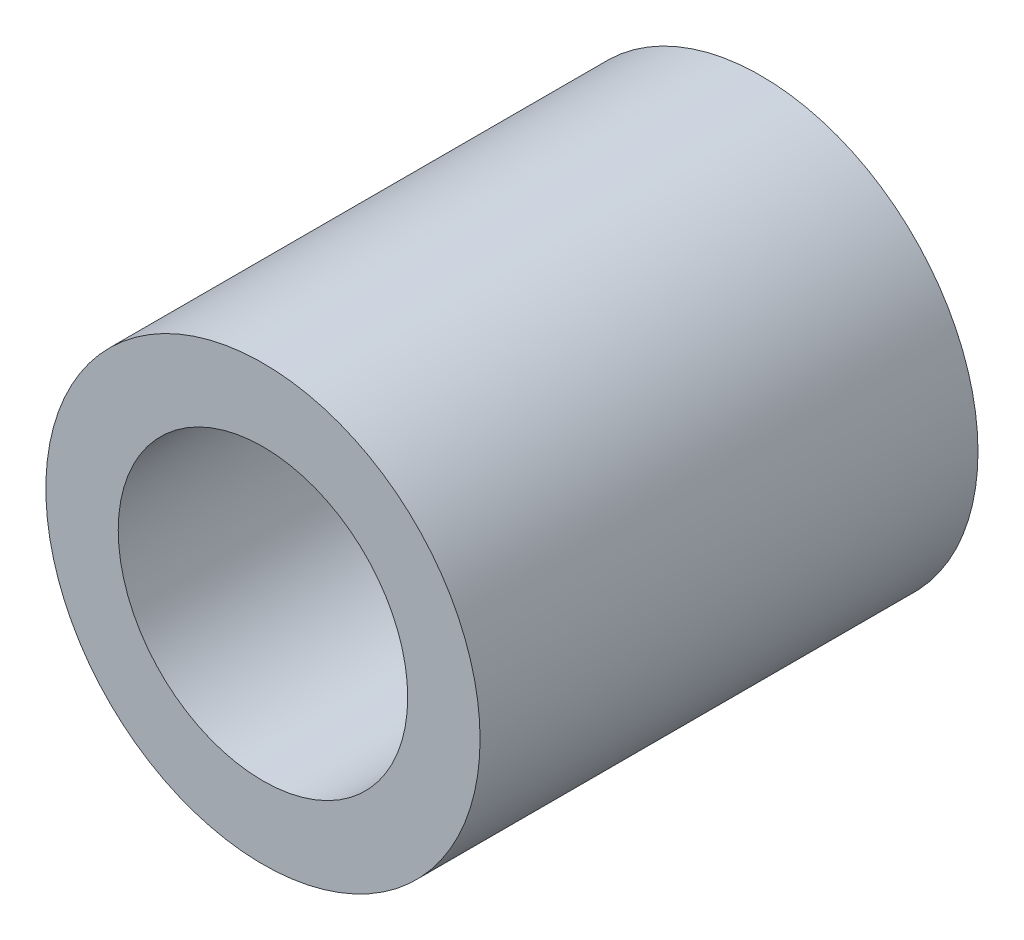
ISO-10303-21;
HEADER;
FILE_DESCRIPTION(('STEP AP214'),'2;1');
FILE_NAME('part.step','',(''),(''),'','','');
FILE_SCHEMA(('AUTOMOTIVE_DESIGN { 1 0 10303 214 1 1 1 1 }'));
ENDSEC;
DATA;
#1=APPLICATION_CONTEXT('core data for automotive mechanical design processes');
#2=APPLICATION_PROTOCOL_DEFINITION('international standard','automotive_design',2000,#1);
#3=PRODUCT_CONTEXT('',#1,'mechanical');
#4=PRODUCT('Part','Part','',(#3));
#5=PRODUCT_RELATED_PRODUCT_CATEGORY('part','',(#4));
#6=PRODUCT_DEFINITION_FORMATION('','',#4);
#7=PRODUCT_DEFINITION_CONTEXT('part definition',#1,'design');
#8=PRODUCT_DEFINITION('design','',#6,#7);
#9=PRODUCT_DEFINITION_SHAPE('','',#8);
#10=(LENGTH_UNIT() NAMED_UNIT(*) SI_UNIT(.MILLI.,.METRE.));
#11=(NAMED_UNIT(*) PLANE_ANGLE_UNIT() SI_UNIT($,.RADIAN.));
#12=(NAMED_UNIT(*) SI_UNIT($,.STERADIAN.) SOLID_ANGLE_UNIT());
#13=UNCERTAINTY_MEASURE_WITH_UNIT(LENGTH_MEASURE(1.E-05),#10,'distance_accuracy_value','');
#14=(GEOMETRIC_REPRESENTATION_CONTEXT(3) GLOBAL_UNCERTAINTY_ASSIGNED_CONTEXT((#13)) GLOBAL_UNIT_ASSIGNED_CONTEXT((#10,
#11,#12)) REPRESENTATION_CONTEXT('',''));
#15=CARTESIAN_POINT('',(0.,0.,0.));
#16=DIRECTION('',(0.,0.,1.));
#17=DIRECTION('',(1.,0.,0.));
#18=AXIS2_PLACEMENT_3D('',#15,#16,#17);
#19=CARTESIAN_POINT('',(0.,0.,10.922));
#20=DIRECTION('',(0.,0.,1.));
#21=DIRECTION('',(1.,0.,0.));
#22=AXIS2_PLACEMENT_3D('',#19,#20,#21);
#23=PLANE('',#22);
#24=CARTESIAN_POINT('',(0.,0.,10.922));
#25=DIRECTION('',(0.,0.,1.));
#26=DIRECTION('',(1.,0.,0.));
#27=AXIS2_PLACEMENT_3D('',#24,#25,#26);
#28=CIRCLE('',#27,4.7625);
#29=CARTESIAN_POINT('',(4.7625,0.,10.922));
#30=VERTEX_POINT('',#29);
#31=EDGE_CURVE('E10',#30,#30,#28,.T.);
#32=ORIENTED_EDGE('',*,*,#31,.T.);
#33=EDGE_LOOP('',(#32));
#34=FACE_BOUND('',#33,.T.);
#35=CARTESIAN_POINT('',(0.,0.,10.922));
#36=DIRECTION('',(0.,0.,1.));
#37=DIRECTION('',(1.,0.,0.));
#38=AXIS2_PLACEMENT_3D('',#35,#36,#37);
#39=CIRCLE('',#38,3.175);
#40=CARTESIAN_POINT('',(3.175,0.,10.922));
#41=VERTEX_POINT('',#40);
#42=EDGE_CURVE('E42',#41,#41,#39,.T.);
#43=ORIENTED_EDGE('',*,*,#42,.F.);
#44=EDGE_LOOP('',(#43));
#45=FACE_BOUND('',#44,.T.);
#46=ADVANCED_FACE('F31',(#34,#45),#23,.T.);
#47=CARTESIAN_POINT('',(0.,0.,0.));
#48=DIRECTION('',(0.,0.,1.));
#49=DIRECTION('',(1.,0.,0.));
#50=AXIS2_PLACEMENT_3D('',#47,#48,#49);
#51=PLANE('',#50);
#52=CARTESIAN_POINT('',(0.,0.,0.));
#53=DIRECTION('',(0.,0.,1.));
#54=DIRECTION('',(1.,0.,0.));
#55=AXIS2_PLACEMENT_3D('',#52,#53,#54);
#56=CIRCLE('',#55,4.7625);
#57=CARTESIAN_POINT('',(4.7625,0.,0.));
#58=VERTEX_POINT('',#57);
#59=EDGE_CURVE('E35',#58,#58,#56,.T.);
#60=ORIENTED_EDGE('',*,*,#59,.F.);
#61=EDGE_LOOP('',(#60));
#62=FACE_BOUND('',#61,.T.);
#63=CARTESIAN_POINT('',(0.,0.,0.));
#64=DIRECTION('',(0.,0.,1.));
#65=DIRECTION('',(1.,0.,0.));
#66=AXIS2_PLACEMENT_3D('',#63,#64,#65);
#67=CIRCLE('',#66,3.175);
#68=CARTESIAN_POINT('',(3.175,0.,0.));
#69=VERTEX_POINT('',#68);
#70=EDGE_CURVE('E44',#69,#69,#67,.T.);
#71=ORIENTED_EDGE('',*,*,#70,.T.);
#72=EDGE_LOOP('',(#71));
#73=FACE_BOUND('',#72,.T.);
#74=ADVANCED_FACE('F54',(#62,#73),#51,.F.);
#75=CARTESIAN_POINT('',(0.,0.,10.922));
#76=DIRECTION('',(0.,0.,-1.));
#77=DIRECTION('',(-1.,0.,0.));
#78=AXIS2_PLACEMENT_3D('',#75,#76,#77);
#79=CYLINDRICAL_SURFACE('',#78,4.7625);
#80=ORIENTED_EDGE('',*,*,#31,.F.);
#81=EDGE_LOOP('',(#80));
#82=FACE_BOUND('',#81,.T.);
#83=ORIENTED_EDGE('',*,*,#59,.T.);
#84=EDGE_LOOP('',(#83));
#85=FACE_BOUND('',#84,.T.);
#86=ADVANCED_FACE('F33',(#82,#85),#79,.T.);
#87=CARTESIAN_POINT('',(0.,0.,10.922));
#88=DIRECTION('',(0.,0.,-1.));
#89=DIRECTION('',(-1.,0.,0.));
#90=AXIS2_PLACEMENT_3D('',#87,#88,#89);
#91=CYLINDRICAL_SURFACE('',#90,3.175);
#92=ORIENTED_EDGE('',*,*,#42,.T.);
#93=EDGE_LOOP('',(#92));
#94=FACE_BOUND('',#93,.T.);
#95=ORIENTED_EDGE('',*,*,#70,.F.);
#96=EDGE_LOOP('',(#95));
#97=FACE_BOUND('',#96,.T.);
#98=ADVANCED_FACE('F50',(#94,#97),#91,.F.);
#99=CLOSED_SHELL('',(#46,#74,#86,#98));
#100=MANIFOLD_SOLID_BREP('B2',#99);
#101=ADVANCED_BREP_SHAPE_REPRESENTATION('',(#18,#100),#14);
#102=SHAPE_DEFINITION_REPRESENTATION(#9,#101);
ENDSEC;
END-ISO-10303-21;
